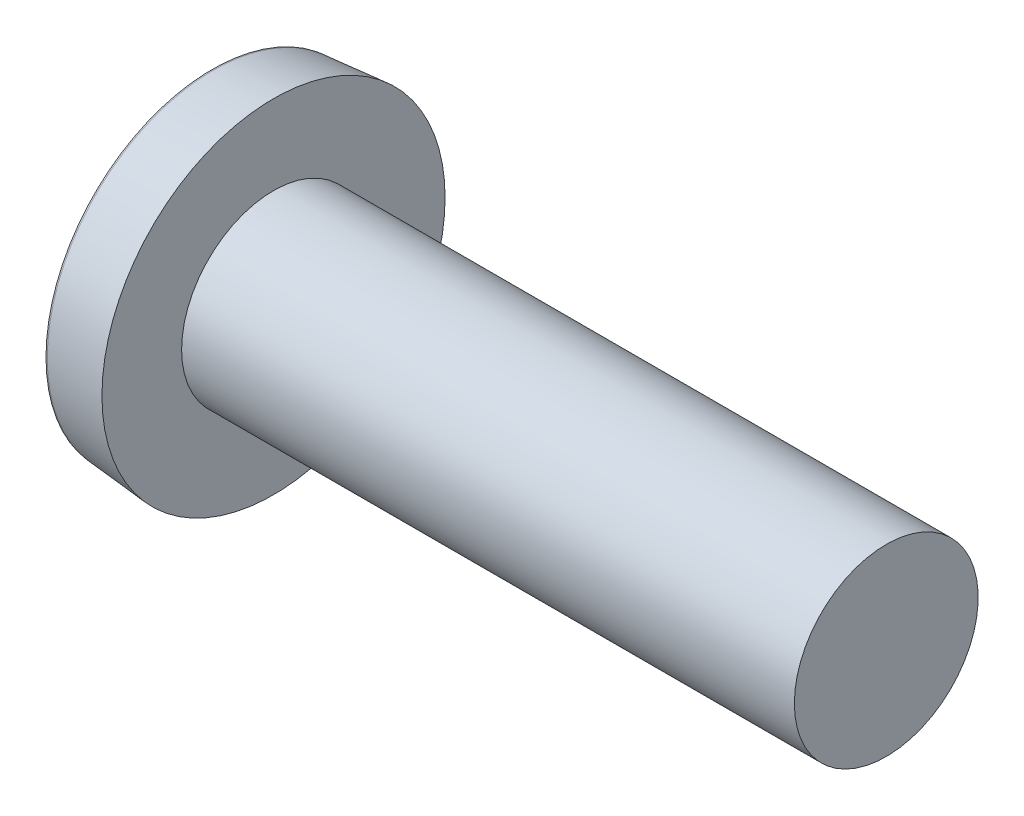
ISO-10303-21;
HEADER;
FILE_DESCRIPTION(('STEP AP214'),'2;1');
FILE_NAME('part.step','',(''),(''),'','','');
FILE_SCHEMA(('AUTOMOTIVE_DESIGN { 1 0 10303 214 1 1 1 1 }'));
ENDSEC;
DATA;
#1=APPLICATION_CONTEXT('core data for automotive mechanical design processes');
#2=APPLICATION_PROTOCOL_DEFINITION('international standard','automotive_design',2000,#1);
#3=PRODUCT_CONTEXT('',#1,'mechanical');
#4=PRODUCT('Part','Part','',(#3));
#5=PRODUCT_RELATED_PRODUCT_CATEGORY('part','',(#4));
#6=PRODUCT_DEFINITION_FORMATION('','',#4);
#7=PRODUCT_DEFINITION_CONTEXT('part definition',#1,'design');
#8=PRODUCT_DEFINITION('design','',#6,#7);
#9=PRODUCT_DEFINITION_SHAPE('','',#8);
#10=(LENGTH_UNIT() NAMED_UNIT(*) SI_UNIT(.MILLI.,.METRE.));
#11=(NAMED_UNIT(*) PLANE_ANGLE_UNIT() SI_UNIT($,.RADIAN.));
#12=(NAMED_UNIT(*) SI_UNIT($,.STERADIAN.) SOLID_ANGLE_UNIT());
#13=UNCERTAINTY_MEASURE_WITH_UNIT(LENGTH_MEASURE(1.E-05),#10,'distance_accuracy_value','');
#14=(GEOMETRIC_REPRESENTATION_CONTEXT(3) GLOBAL_UNCERTAINTY_ASSIGNED_CONTEXT((#13)) GLOBAL_UNIT_ASSIGNED_CONTEXT((#10,
#11,#12)) REPRESENTATION_CONTEXT('',''));
#15=CARTESIAN_POINT('',(0.,0.,0.));
#16=DIRECTION('',(0.,0.,1.));
#17=DIRECTION('',(1.,0.,0.));
#18=AXIS2_PLACEMENT_3D('',#15,#16,#17);
#19=CARTESIAN_POINT('',(-25.4,0.,0.));
#20=DIRECTION('',(-1.,0.,0.));
#21=DIRECTION('',(0.,0.,1.));
#22=AXIS2_PLACEMENT_3D('',#19,#20,#21);
#23=CYLINDRICAL_SURFACE('',#22,1.5);
#24=CARTESIAN_POINT('',(11.8,0.,0.));
#25=DIRECTION('',(-1.,0.,0.));
#26=DIRECTION('',(0.,0.,1.));
#27=AXIS2_PLACEMENT_3D('',#24,#25,#26);
#28=CIRCLE('',#27,1.5);
#29=CARTESIAN_POINT('',(11.8,0.,1.5));
#30=VERTEX_POINT('',#29);
#31=EDGE_CURVE('E38',#30,#30,#28,.T.);
#32=ORIENTED_EDGE('',*,*,#31,.T.);
#33=EDGE_LOOP('',(#32));
#34=FACE_BOUND('',#33,.T.);
#35=CARTESIAN_POINT('',(1.8,0.,0.));
#36=DIRECTION('',(-1.,0.,0.));
#37=DIRECTION('',(0.,0.,1.));
#38=AXIS2_PLACEMENT_3D('',#35,#36,#37);
#39=CIRCLE('',#38,1.5);
#40=CARTESIAN_POINT('',(1.8,0.,1.5));
#41=VERTEX_POINT('',#40);
#42=EDGE_CURVE('E47',#41,#41,#39,.T.);
#43=ORIENTED_EDGE('',*,*,#42,.F.);
#44=EDGE_LOOP('',(#43));
#45=FACE_BOUND('',#44,.T.);
#46=ADVANCED_FACE('F30',(#34,#45),#23,.T.);
#47=CARTESIAN_POINT('',(11.8,1.5,0.));
#48=DIRECTION('',(1.,0.,0.));
#49=DIRECTION('',(0.,0.,-1.));
#50=AXIS2_PLACEMENT_3D('',#47,#48,#49);
#51=PLANE('',#50);
#52=ORIENTED_EDGE('',*,*,#31,.F.);
#53=EDGE_LOOP('',(#52));
#54=FACE_BOUND('',#53,.T.);
#55=ADVANCED_FACE('F68',(#54),#51,.T.);
#56=CARTESIAN_POINT('',(0.,0.,0.));
#57=DIRECTION('',(1.,0.,0.));
#58=DIRECTION('',(0.,0.,-1.));
#59=AXIS2_PLACEMENT_3D('',#56,#57,#58);
#60=CONICAL_SURFACE('',#59,2.64252040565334,0.087266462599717);
#61=CARTESIAN_POINT('',(0.821559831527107,0.,0.));
#62=DIRECTION('',(-1.,0.,0.));
#63=DIRECTION('',(0.,0.,1.));
#64=AXIS2_PLACEMENT_3D('',#61,#62,#63);
#65=CIRCLE('',#64,2.71439757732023);
#66=CARTESIAN_POINT('',(0.821559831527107,0.,2.71439757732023));
#67=VERTEX_POINT('',#66);
#68=EDGE_CURVE('E10',#67,#67,#65,.F.);
#69=ORIENTED_EDGE('',*,*,#68,.T.);
#70=EDGE_LOOP('',(#69));
#71=FACE_BOUND('',#70,.T.);
#72=CARTESIAN_POINT('',(1.8,0.,0.));
#73=DIRECTION('',(-1.,0.,0.));
#74=DIRECTION('',(0.,0.,1.));
#75=AXIS2_PLACEMENT_3D('',#72,#73,#74);
#76=CIRCLE('',#75,2.8);
#77=CARTESIAN_POINT('',(1.8,0.,2.8));
#78=VERTEX_POINT('',#77);
#79=EDGE_CURVE('E42',#78,#78,#76,.T.);
#80=ORIENTED_EDGE('',*,*,#79,.T.);
#81=EDGE_LOOP('',(#80));
#82=FACE_BOUND('',#81,.T.);
#83=ADVANCED_FACE('F64',(#71,#82),#60,.T.);
#84=CARTESIAN_POINT('',(1.8,1.5,0.));
#85=DIRECTION('',(-1.,0.,0.));
#86=DIRECTION('',(0.,0.,1.));
#87=AXIS2_PLACEMENT_3D('',#84,#85,#86);
#88=PLANE('',#87);
#89=ORIENTED_EDGE('',*,*,#79,.F.);
#90=EDGE_LOOP('',(#89));
#91=FACE_BOUND('',#90,.T.);
#92=ORIENTED_EDGE('',*,*,#42,.T.);
#93=EDGE_LOOP('',(#92));
#94=FACE_BOUND('',#93,.T.);
#95=ADVANCED_FACE('F58',(#91,#94),#88,.F.);
#96=CARTESIAN_POINT('',(0.9,0.,0.));
#97=DIRECTION('',(-1.,0.,0.));
#98=DIRECTION('',(0.,0.,1.));
#99=AXIS2_PLACEMENT_3D('',#96,#97,#98);
#100=TOROIDAL_SURFACE('',#99,1.81782234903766,0.9);
#101=CARTESIAN_POINT('',(0.799087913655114,0.,0.));
#102=DIRECTION('',(1.,0.,0.));
#103=DIRECTION('',(0.,0.,-1.));
#104=AXIS2_PLACEMENT_3D('',#101,#102,#103);
#105=CIRCLE('',#104,2.71214709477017);
#106=CARTESIAN_POINT('',(0.799087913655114,0.,-2.71214709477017));
#107=VERTEX_POINT('',#106);
#108=EDGE_CURVE('E34',#107,#107,#105,.F.);
#109=ORIENTED_EDGE('',*,*,#108,.F.);
#110=EDGE_LOOP('',(#109));
#111=FACE_BOUND('',#110,.T.);
#112=ORIENTED_EDGE('',*,*,#68,.F.);
#113=EDGE_LOOP('',(#112));
#114=FACE_BOUND('',#113,.T.);
#115=ADVANCED_FACE('F32',(#111,#114),#100,.T.);
#116=CARTESIAN_POINT('',(0.799087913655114,-5.,-3.622778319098));
#117=DIRECTION('',(1.,0.,0.));
#118=DIRECTION('',(0.,0.,-1.));
#119=AXIS2_PLACEMENT_3D('',#116,#117,#118);
#120=PLANE('',#119);
#121=ORIENTED_EDGE('',*,*,#108,.T.);
#122=EDGE_LOOP('',(#121));
#123=FACE_BOUND('',#122,.T.);
#124=ADVANCED_FACE('F54',(#123),#120,.F.);
#125=CLOSED_SHELL('',(#46,#55,#83,#95,#115,#124));
#126=MANIFOLD_SOLID_BREP('B2',#125);
#127=ADVANCED_BREP_SHAPE_REPRESENTATION('',(#18,#126),#14);
#128=SHAPE_DEFINITION_REPRESENTATION(#9,#127);
ENDSEC;
END-ISO-10303-21;
